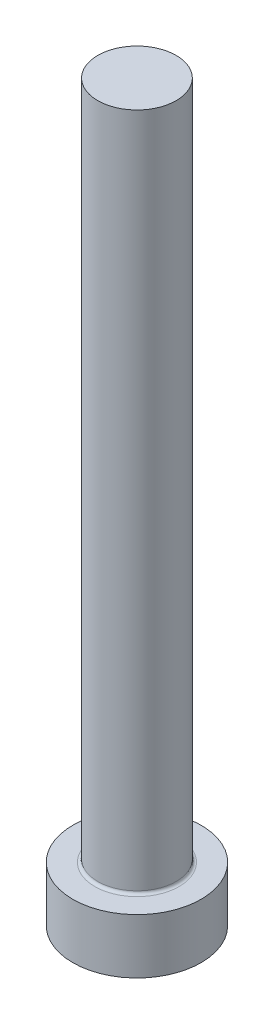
from build123d import *


with BuildPart() as part:
    # Sketch1 → Revolve3 (revolve)
    with BuildSketch(Plane.XY, mode=Mode.PRIVATE) as revolve3_sk:
        with BuildLine():
            Line((0, 0), (5.5499, 0))
            Line((5.5499, 0), (5.5499, 4.7498))
            Line((5.5499, 4.7498), (3.6449, 4.7498))
            ThreePointArc((3.6449, 4.7498), (3.465294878, 4.824194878), (3.3909, 5.0038))
            Line((3.3909, 5.0038), (3.3909, 63.5))
            Line((3.3909, 63.5), (0, 63.5))
            Line((0, 63.5), (0, 0))
        make_face()
    revolve(revolve3_sk.sketch.rotate(Axis((0, 0, 0), (0, -1, 0)), 90), axis=Axis((0, 0, 0), (0, -1, 0)))


solid = part.part
